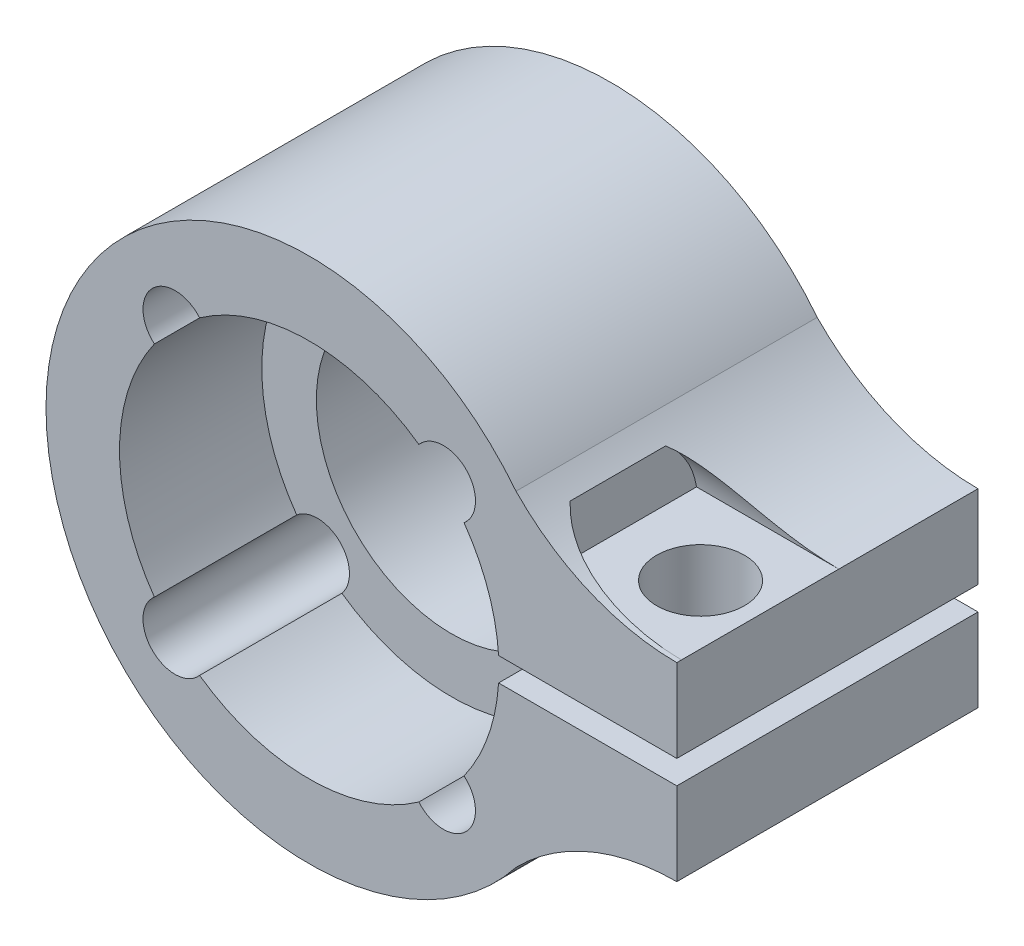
from build123d import *

# Parameters (mm, degrees)
EXTRUDE1_DEPTH            = 12.7
F_6_32_TAPPED_HOLE3_D     = 2.7051
SKETCH14_R                = 1.85
CUT_EXTRUDE6_DEPTH        = 24.153833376
F_6_32_TAPPED_HOLE5_D     = 2.7051
F_6_32_TAPPED_HOLE5_DEPTH = 50.8
F_6_32_TAPPED_HOLE5_TIP   = 0.81269403
CUT_EXTRUDE26_DEPTH       = 6
SKETCH25_R                = 5.7
CUT_EXTRUDE27_DEPTH       = 23.907422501
SKETCH26_R                = 8
CUT_EXTRUDE28_DEPTH       = 6


with BuildPart() as part:
    # Sketch1 → Extrude1 (new body)
    with BuildSketch(Plane.XY):
        with BuildLine():
            Line((0, 0), (0, 0.5))
            Line((0, 0.5), (15.5, 0.5))
            Line((15.5, 0.5), (15.5, 4))
            ThreePointArc((15.5, 4), (11.819050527, 4.746581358), (8.719864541, 6.868330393))
            ThreePointArc((8.719864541, 6.868330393), (-11.1, 0), (8.719864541, -6.868330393))
            ThreePointArc((8.719864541, -6.868330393), (11.819050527, -4.746581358), (15.5, -4))
            Line((15.5, -4), (15.5, -0.5))
            Line((15.5, -0.5), (0, -0.5))
            Line((0, -0.5), (0, 0))
        make_face()
    extrude(amount=-EXTRUDE1_DEPTH)

    # 6-32 Tapped Hole3 (through all)
    with Locations(Plane(origin=(-5.656516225, 5.657192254, 0), x_dir=(1, 0, 0), z_dir=(0, 0, 1))):
        with Locations((0, 0), (11.313708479, -0.000676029), (11.31303245, -11.314384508), (-0.000676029, -11.313708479)):
            Hole(F_6_32_TAPPED_HOLE3_D / 2)

    # Sketch14 → Cut-Extrude6 (cut, through all)
    with BuildSketch(Plane.XZ.offset(-0.5)):
        with Locations(Location((13, -3.5, 0), (0, 0, 270))):
            Circle(SKETCH14_R)
    extrude(amount=-CUT_EXTRUDE6_DEPTH, mode=Mode.SUBTRACT)

    # 6-32 Tapped Hole5
    with Locations(Plane(origin=(0, -0.5, 0), x_dir=(-1, 0, 0), z_dir=(0, 1, 0))):
        with Locations((-13, -3.5)):
            Hole(F_6_32_TAPPED_HOLE5_D / 2, depth=F_6_32_TAPPED_HOLE5_DEPTH)
            with Locations((0, 0, -(F_6_32_TAPPED_HOLE5_DEPTH + F_6_32_TAPPED_HOLE5_TIP / 2))):  # 118° drill point
                Cone(0, F_6_32_TAPPED_HOLE5_D / 2, F_6_32_TAPPED_HOLE5_TIP, mode=Mode.SUBTRACT)

    # Sketch24 → Cut-Extrude26 (cut)
    with BuildSketch(Plane(origin=(15.5, 0, 0), x_dir=(0, 0, -1), z_dir=(1, 0, 0))):
        with BuildLine():
            Line((0.2, 4), (6.832300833, 4))
            ThreePointArc((6.832300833, 4), (3.516150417, 6.820400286), (0.2, 4))
        make_face()
    extrude(amount=-CUT_EXTRUDE26_DEPTH, mode=Mode.SUBTRACT)

    # Sketch25 → Cut-Extrude27 (cut, through all)
    with BuildSketch(Plane.XY):
        Circle(SKETCH25_R)
    extrude(amount=-CUT_EXTRUDE27_DEPTH, mode=Mode.SUBTRACT)

    # Sketch26 → Cut-Extrude28 (cut)
    with BuildSketch(Plane.XY):
        Circle(SKETCH26_R)
    extrude(amount=-CUT_EXTRUDE28_DEPTH, mode=Mode.SUBTRACT)


solid = part.part
